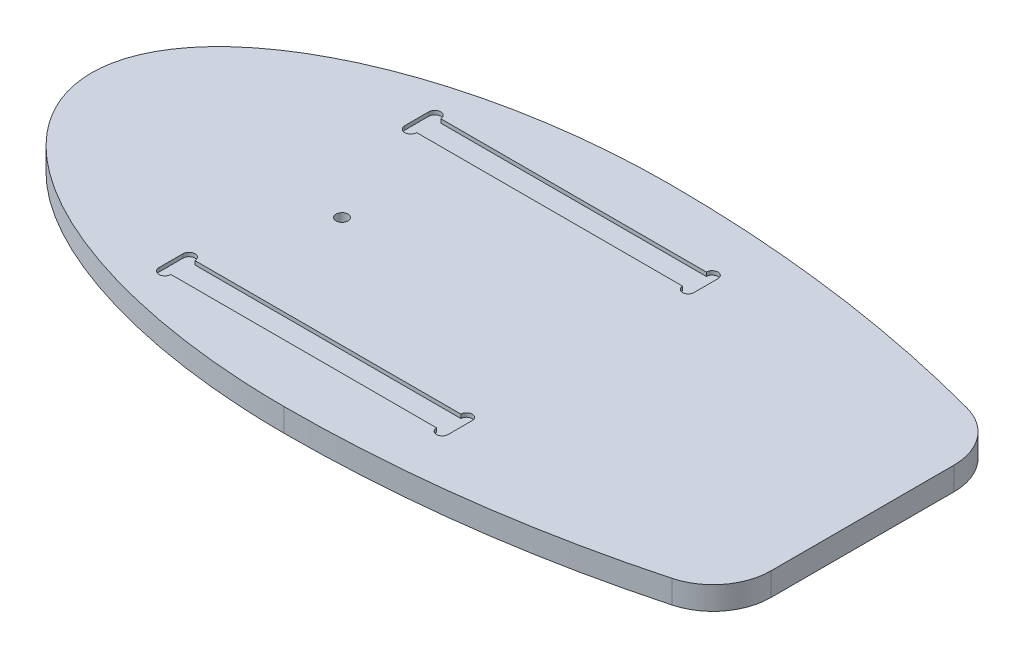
ISO-10303-21;
HEADER;
FILE_DESCRIPTION(('STEP AP214'),'2;1');
FILE_NAME('part.step','',(''),(''),'','','');
FILE_SCHEMA(('AUTOMOTIVE_DESIGN { 1 0 10303 214 1 1 1 1 }'));
ENDSEC;
DATA;
#1=APPLICATION_CONTEXT('core data for automotive mechanical design processes');
#2=APPLICATION_PROTOCOL_DEFINITION('international standard','automotive_design',2000,#1);
#3=PRODUCT_CONTEXT('',#1,'mechanical');
#4=PRODUCT('Part','Part','',(#3));
#5=PRODUCT_RELATED_PRODUCT_CATEGORY('part','',(#4));
#6=PRODUCT_DEFINITION_FORMATION('','',#4);
#7=PRODUCT_DEFINITION_CONTEXT('part definition',#1,'design');
#8=PRODUCT_DEFINITION('design','',#6,#7);
#9=PRODUCT_DEFINITION_SHAPE('','',#8);
#10=(LENGTH_UNIT() NAMED_UNIT(*) SI_UNIT(.MILLI.,.METRE.));
#11=(NAMED_UNIT(*) PLANE_ANGLE_UNIT() SI_UNIT($,.RADIAN.));
#12=(NAMED_UNIT(*) SI_UNIT($,.STERADIAN.) SOLID_ANGLE_UNIT());
#13=UNCERTAINTY_MEASURE_WITH_UNIT(LENGTH_MEASURE(1.E-05),#10,'distance_accuracy_value','');
#14=(GEOMETRIC_REPRESENTATION_CONTEXT(3) GLOBAL_UNCERTAINTY_ASSIGNED_CONTEXT((#13)) GLOBAL_UNIT_ASSIGNED_CONTEXT((#10,
#11,#12)) REPRESENTATION_CONTEXT('',''));
#15=CARTESIAN_POINT('',(0.,0.,0.));
#16=DIRECTION('',(0.,0.,1.));
#17=DIRECTION('',(1.,0.,0.));
#18=AXIS2_PLACEMENT_3D('',#15,#16,#17);
#19=CARTESIAN_POINT('',(0.,0.,0.));
#20=DIRECTION('',(0.,1.,0.));
#21=DIRECTION('',(0.,0.,1.));
#22=AXIS2_PLACEMENT_3D('',#19,#20,#21);
#23=PLANE('',#22);
#24=CARTESIAN_POINT('',(-70.,0.,0.));
#25=DIRECTION('',(0.,1.,0.));
#26=DIRECTION('',(0.,0.,1.));
#27=AXIS2_PLACEMENT_3D('',#24,#25,#26);
#28=CIRCLE('',#27,3.1);
#29=CARTESIAN_POINT('',(-70.,0.,3.1));
#30=VERTEX_POINT('',#29);
#31=EDGE_CURVE('E445',#30,#30,#28,.T.);
#32=ORIENTED_EDGE('',*,*,#31,.F.);
#33=EDGE_LOOP('',(#32));
#34=FACE_BOUND('',#33,.T.);
#35=CARTESIAN_POINT('',(-91.8999999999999,0.,-57.5));
#36=DIRECTION('',(0.,1.,0.));
#37=DIRECTION('',(0.,0.,1.));
#38=AXIS2_PLACEMENT_3D('',#35,#36,#37);
#39=CIRCLE('',#38,3.10000000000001);
#40=CARTESIAN_POINT('',(-94.9999999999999,0.,-57.5));
#41=VERTEX_POINT('',#40);
#42=CARTESIAN_POINT('',(-88.7999999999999,0.,-57.5));
#43=VERTEX_POINT('',#42);
#44=EDGE_CURVE('E187',#41,#43,#39,.T.);
#45=ORIENTED_EDGE('',*,*,#44,.F.);
#46=DIRECTION('',(0.,0.,1.));
#47=VECTOR('',#46,1.);
#48=CARTESIAN_POINT('',(-95.,0.,-70.));
#49=LINE('',#48,#47);
#50=CARTESIAN_POINT('',(-95.,0.,-70.));
#51=VERTEX_POINT('',#50);
#52=EDGE_CURVE('E198',#51,#41,#49,.T.);
#53=ORIENTED_EDGE('',*,*,#52,.F.);
#54=CARTESIAN_POINT('',(-91.9,0.,-70.));
#55=DIRECTION('',(0.,1.,0.));
#56=DIRECTION('',(0.,0.,1.));
#57=AXIS2_PLACEMENT_3D('',#54,#55,#56);
#58=CIRCLE('',#57,3.10000000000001);
#59=CARTESIAN_POINT('',(-88.8,0.,-70.));
#60=VERTEX_POINT('',#59);
#61=EDGE_CURVE('E203',#60,#51,#58,.T.);
#62=ORIENTED_EDGE('',*,*,#61,.F.);
#63=DIRECTION('',(1.,0.,0.));
#64=VECTOR('',#63,1.);
#65=CARTESIAN_POINT('',(-88.8,0.,-70.));
#66=LINE('',#65,#64);
#67=CARTESIAN_POINT('',(49.,0.,-70.));
#68=VERTEX_POINT('',#67);
#69=EDGE_CURVE('E463',#60,#68,#66,.T.);
#70=ORIENTED_EDGE('',*,*,#69,.T.);
#71=CARTESIAN_POINT('',(52.,0.,-70.));
#72=DIRECTION('',(0.,1.,0.));
#73=DIRECTION('',(0.,0.,1.));
#74=AXIS2_PLACEMENT_3D('',#71,#72,#73);
#75=CIRCLE('',#74,3.);
#76=CARTESIAN_POINT('',(55.,0.,-70.));
#77=VERTEX_POINT('',#76);
#78=EDGE_CURVE('E466',#77,#68,#75,.T.);
#79=ORIENTED_EDGE('',*,*,#78,.F.);
#80=DIRECTION('',(0.,0.,1.));
#81=VECTOR('',#80,1.);
#82=CARTESIAN_POINT('',(55.,0.,-70.));
#83=LINE('',#82,#81);
#84=CARTESIAN_POINT('',(55.,0.,-57.5));
#85=VERTEX_POINT('',#84);
#86=EDGE_CURVE('E469',#77,#85,#83,.T.);
#87=ORIENTED_EDGE('',*,*,#86,.T.);
#88=CARTESIAN_POINT('',(52.0884145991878,0.,-57.5));
#89=DIRECTION('',(0.,1.,0.));
#90=DIRECTION('',(0.,0.,1.));
#91=AXIS2_PLACEMENT_3D('',#88,#89,#90);
#92=CIRCLE('',#91,2.91158540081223);
#93=CARTESIAN_POINT('',(49.1768291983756,0.,-57.5));
#94=VERTEX_POINT('',#93);
#95=EDGE_CURVE('E215',#94,#85,#92,.T.);
#96=ORIENTED_EDGE('',*,*,#95,.F.);
#97=DIRECTION('',(1.,0.,0.));
#98=VECTOR('',#97,1.);
#99=CARTESIAN_POINT('',(-88.7999999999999,0.,-57.5));
#100=LINE('',#99,#98);
#101=EDGE_CURVE('E209',#43,#94,#100,.T.);
#102=ORIENTED_EDGE('',*,*,#101,.F.);
#103=EDGE_LOOP('',(#45,#53,#62,#70,#79,#87,#96,#102));
#104=FACE_BOUND('',#103,.T.);
#105=CARTESIAN_POINT('',(-1.43868235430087E-13,0.,-584.654570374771));
#106=DIRECTION('',(0.,1.,0.));
#107=DIRECTION('',(0.,0.,1.));
#108=AXIS2_PLACEMENT_3D('',#105,#106,#107);
#109=CIRCLE('',#108,684.654570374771);
#110=CARTESIAN_POINT('',(0.,0.,100.));
#111=VERTEX_POINT('',#110);
#112=CARTESIAN_POINT('',(177.790367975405,0.,76.5129316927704));
#113=VERTEX_POINT('',#112);
#114=EDGE_CURVE('E347',#111,#113,#109,.T.);
#115=ORIENTED_EDGE('',*,*,#114,.T.);
#116=CARTESIAN_POINT('',(170.,0.,47.5420813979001));
#117=DIRECTION('',(0.,1.,0.));
#118=DIRECTION('',(0.,0.,1.));
#119=AXIS2_PLACEMENT_3D('',#116,#117,#118);
#120=CIRCLE('',#119,30.);
#121=CARTESIAN_POINT('',(200.,0.,47.5420813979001));
#122=VERTEX_POINT('',#121);
#123=EDGE_CURVE('E350',#113,#122,#120,.T.);
#124=ORIENTED_EDGE('',*,*,#123,.T.);
#125=DIRECTION('',(0.,0.,1.));
#126=VECTOR('',#125,1.);
#127=CARTESIAN_POINT('',(200.,0.,-70.136908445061));
#128=LINE('',#127,#126);
#129=CARTESIAN_POINT('',(200.,0.,-47.5420813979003));
#130=VERTEX_POINT('',#129);
#131=EDGE_CURVE('E344',#130,#122,#128,.T.);
#132=ORIENTED_EDGE('',*,*,#131,.F.);
#133=CARTESIAN_POINT('',(170.,0.,-47.5420813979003));
#134=DIRECTION('',(0.,1.,0.));
#135=DIRECTION('',(0.,0.,1.));
#136=AXIS2_PLACEMENT_3D('',#133,#134,#135);
#137=CIRCLE('',#136,30.);
#138=CARTESIAN_POINT('',(177.790367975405,0.,-76.5129316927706));
#139=VERTEX_POINT('',#138);
#140=EDGE_CURVE('E366',#130,#139,#137,.T.);
#141=ORIENTED_EDGE('',*,*,#140,.T.);
#142=CARTESIAN_POINT('',(0.,0.,584.654570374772));
#143=DIRECTION('',(0.,-1.,0.));
#144=DIRECTION('',(0.,0.,-1.));
#145=AXIS2_PLACEMENT_3D('',#142,#143,#144);
#146=CIRCLE('',#145,684.654570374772);
#147=CARTESIAN_POINT('',(0.,0.,-100.));
#148=VERTEX_POINT('',#147);
#149=EDGE_CURVE('E302',#148,#139,#146,.T.);
#150=ORIENTED_EDGE('',*,*,#149,.F.);
#151=CARTESIAN_POINT('',(0.,0.,0.));
#152=DIRECTION('',(0.,1.,0.));
#153=DIRECTION('',(-1.,0.,0.));
#154=AXIS2_PLACEMENT_3D('',#151,#152,#153);
#155=ELLIPSE('',#154,200.,100.);
#156=EDGE_CURVE('E296',#148,#111,#155,.T.);
#157=ORIENTED_EDGE('',*,*,#156,.T.);
#158=EDGE_LOOP('',(#115,#124,#132,#141,#150,#157));
#159=FACE_BOUND('',#158,.T.);
#160=DIRECTION('',(0.,0.,-1.));
#161=VECTOR('',#160,1.);
#162=CARTESIAN_POINT('',(-95.,0.,70.));
#163=LINE('',#162,#161);
#164=CARTESIAN_POINT('',(-95.,0.,70.));
#165=VERTEX_POINT('',#164);
#166=CARTESIAN_POINT('',(-94.9999999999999,0.,57.5));
#167=VERTEX_POINT('',#166);
#168=EDGE_CURVE('E243',#165,#167,#163,.T.);
#169=ORIENTED_EDGE('',*,*,#168,.T.);
#170=CARTESIAN_POINT('',(-91.8999999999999,0.,57.5));
#171=DIRECTION('',(0.,-1.,0.));
#172=DIRECTION('',(0.,0.,-1.));
#173=AXIS2_PLACEMENT_3D('',#170,#171,#172);
#174=CIRCLE('',#173,3.10000000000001);
#175=CARTESIAN_POINT('',(-88.7999999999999,0.,57.5));
#176=VERTEX_POINT('',#175);
#177=EDGE_CURVE('E210',#167,#176,#174,.T.);
#178=ORIENTED_EDGE('',*,*,#177,.T.);
#179=DIRECTION('',(1.,0.,0.));
#180=VECTOR('',#179,1.);
#181=CARTESIAN_POINT('',(-88.7999999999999,0.,57.5));
#182=LINE('',#181,#180);
#183=CARTESIAN_POINT('',(49.1768291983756,0.,57.4999999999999));
#184=VERTEX_POINT('',#183);
#185=EDGE_CURVE('E213',#176,#184,#182,.T.);
#186=ORIENTED_EDGE('',*,*,#185,.T.);
#187=CARTESIAN_POINT('',(52.0884145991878,0.,57.4999999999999));
#188=DIRECTION('',(0.,-1.,0.));
#189=DIRECTION('',(0.,0.,-1.));
#190=AXIS2_PLACEMENT_3D('',#187,#188,#189);
#191=CIRCLE('',#190,2.91158540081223);
#192=CARTESIAN_POINT('',(55.0000000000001,0.,57.4999999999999));
#193=VERTEX_POINT('',#192);
#194=EDGE_CURVE('E262',#184,#193,#191,.T.);
#195=ORIENTED_EDGE('',*,*,#194,.T.);
#196=DIRECTION('',(0.,0.,-1.));
#197=VECTOR('',#196,1.);
#198=CARTESIAN_POINT('',(55.0000000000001,0.,69.9999999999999));
#199=LINE('',#198,#197);
#200=CARTESIAN_POINT('',(55.0000000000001,0.,69.9999999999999));
#201=VERTEX_POINT('',#200);
#202=EDGE_CURVE('E265',#201,#193,#199,.T.);
#203=ORIENTED_EDGE('',*,*,#202,.F.);
#204=CARTESIAN_POINT('',(52.0000000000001,0.,69.9999999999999));
#205=DIRECTION('',(0.,-1.,0.));
#206=DIRECTION('',(0.,0.,-1.));
#207=AXIS2_PLACEMENT_3D('',#204,#205,#206);
#208=CIRCLE('',#207,3.);
#209=CARTESIAN_POINT('',(49.0000000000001,0.,69.9999999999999));
#210=VERTEX_POINT('',#209);
#211=EDGE_CURVE('E268',#201,#210,#208,.T.);
#212=ORIENTED_EDGE('',*,*,#211,.T.);
#213=DIRECTION('',(1.,0.,0.));
#214=VECTOR('',#213,1.);
#215=CARTESIAN_POINT('',(-88.8,0.,70.));
#216=LINE('',#215,#214);
#217=CARTESIAN_POINT('',(-88.8,0.,70.));
#218=VERTEX_POINT('',#217);
#219=EDGE_CURVE('E271',#218,#210,#216,.T.);
#220=ORIENTED_EDGE('',*,*,#219,.F.);
#221=CARTESIAN_POINT('',(-91.8999999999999,0.,70.));
#222=DIRECTION('',(0.,-1.,0.));
#223=DIRECTION('',(0.,0.,-1.));
#224=AXIS2_PLACEMENT_3D('',#221,#222,#223);
#225=CIRCLE('',#224,3.10000000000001);
#226=EDGE_CURVE('E274',#218,#165,#225,.T.);
#227=ORIENTED_EDGE('',*,*,#226,.T.);
#228=EDGE_LOOP('',(#169,#178,#186,#195,#203,#212,#220,#227));
#229=FACE_BOUND('',#228,.T.);
#230=ADVANCED_FACE('F33',(#34,#104,#159,#229),#23,.T.);
#231=CARTESIAN_POINT('',(0.,-12.,0.));
#232=DIRECTION('',(0.,1.,0.));
#233=DIRECTION('',(-1.,0.,0.));
#234=AXIS2_PLACEMENT_3D('',#231,#232,#233);
#235=ELLIPSE('',#234,200.,100.);
#236=DIRECTION('',(0.,1.,0.));
#237=VECTOR('',#236,1.);
#238=SURFACE_OF_LINEAR_EXTRUSION('',#235,#237);
#239=ORIENTED_EDGE('',*,*,#156,.F.);
#240=DIRECTION('',(0.,1.,0.));
#241=VECTOR('',#240,1.);
#242=CARTESIAN_POINT('',(0.,-12.,-100.));
#243=LINE('',#242,#241);
#244=CARTESIAN_POINT('',(0.,-12.,-100.));
#245=VERTEX_POINT('',#244);
#246=EDGE_CURVE('E367',#245,#148,#243,.T.);
#247=ORIENTED_EDGE('',*,*,#246,.F.);
#248=CARTESIAN_POINT('',(0.,-12.,100.));
#249=VERTEX_POINT('',#248);
#250=EDGE_CURVE('E297',#245,#249,#235,.T.);
#251=ORIENTED_EDGE('',*,*,#250,.T.);
#252=DIRECTION('',(0.,1.,0.));
#253=VECTOR('',#252,1.);
#254=CARTESIAN_POINT('',(0.,-12.,100.));
#255=LINE('',#254,#253);
#256=EDGE_CURVE('E365',#249,#111,#255,.T.);
#257=ORIENTED_EDGE('',*,*,#256,.T.);
#258=EDGE_LOOP('',(#239,#247,#251,#257));
#259=FACE_BOUND('',#258,.T.);
#260=ADVANCED_FACE('F305',(#259),#238,.T.);
#261=CARTESIAN_POINT('',(0.,-12.,584.654570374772));
#262=DIRECTION('',(0.,1.,0.));
#263=DIRECTION('',(0.,0.,1.));
#264=AXIS2_PLACEMENT_3D('',#261,#262,#263);
#265=CYLINDRICAL_SURFACE('',#264,684.654570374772);
#266=ORIENTED_EDGE('',*,*,#149,.T.);
#267=DIRECTION('',(0.,1.,0.));
#268=VECTOR('',#267,1.);
#269=CARTESIAN_POINT('',(177.790367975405,-12.,-76.5129316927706));
#270=LINE('',#269,#268);
#271=CARTESIAN_POINT('',(177.790367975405,-12.,-76.5129316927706));
#272=VERTEX_POINT('',#271);
#273=EDGE_CURVE('E11',#139,#272,#270,.F.);
#274=ORIENTED_EDGE('',*,*,#273,.T.);
#275=CARTESIAN_POINT('',(0.,-12.,584.654570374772));
#276=DIRECTION('',(0.,-1.,0.));
#277=DIRECTION('',(0.,0.,-1.));
#278=AXIS2_PLACEMENT_3D('',#275,#276,#277);
#279=CIRCLE('',#278,684.654570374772);
#280=EDGE_CURVE('E381',#245,#272,#279,.T.);
#281=ORIENTED_EDGE('',*,*,#280,.F.);
#282=ORIENTED_EDGE('',*,*,#246,.T.);
#283=EDGE_LOOP('',(#266,#274,#281,#282));
#284=FACE_BOUND('',#283,.T.);
#285=ADVANCED_FACE('F308',(#284),#265,.T.);
#286=CARTESIAN_POINT('',(200.,-12.,-70.136908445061));
#287=DIRECTION('',(-1.,0.,0.));
#288=DIRECTION('',(0.,0.,1.));
#289=AXIS2_PLACEMENT_3D('',#286,#287,#288);
#290=PLANE('',#289);
#291=ORIENTED_EDGE('',*,*,#131,.T.);
#292=DIRECTION('',(0.,-1.,0.));
#293=VECTOR('',#292,1.);
#294=CARTESIAN_POINT('',(200.,-12.,47.5420813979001));
#295=LINE('',#294,#293);
#296=CARTESIAN_POINT('',(200.,-12.,47.5420813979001));
#297=VERTEX_POINT('',#296);
#298=EDGE_CURVE('E54',#122,#297,#295,.T.);
#299=ORIENTED_EDGE('',*,*,#298,.T.);
#300=DIRECTION('',(0.,0.,1.));
#301=VECTOR('',#300,1.);
#302=CARTESIAN_POINT('',(200.,-12.,-70.136908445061));
#303=LINE('',#302,#301);
#304=CARTESIAN_POINT('',(200.,-12.,-47.5420813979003));
#305=VERTEX_POINT('',#304);
#306=EDGE_CURVE('E361',#305,#297,#303,.T.);
#307=ORIENTED_EDGE('',*,*,#306,.F.);
#308=DIRECTION('',(0.,1.,0.));
#309=VECTOR('',#308,1.);
#310=CARTESIAN_POINT('',(200.,-12.,-47.5420813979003));
#311=LINE('',#310,#309);
#312=EDGE_CURVE('E346',#305,#130,#311,.T.);
#313=ORIENTED_EDGE('',*,*,#312,.T.);
#314=EDGE_LOOP('',(#291,#299,#307,#313));
#315=FACE_BOUND('',#314,.T.);
#316=ADVANCED_FACE('F336',(#315),#290,.F.);
#317=CARTESIAN_POINT('',(-1.43868235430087E-13,-12.,-584.654570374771));
#318=DIRECTION('',(0.,1.,0.));
#319=DIRECTION('',(0.,0.,1.));
#320=AXIS2_PLACEMENT_3D('',#317,#318,#319);
#321=CYLINDRICAL_SURFACE('',#320,684.654570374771);
#322=CARTESIAN_POINT('',(-1.43868235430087E-13,-12.,-584.654570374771));
#323=DIRECTION('',(0.,1.,0.));
#324=DIRECTION('',(0.,0.,1.));
#325=AXIS2_PLACEMENT_3D('',#322,#323,#324);
#326=CIRCLE('',#325,684.654570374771);
#327=CARTESIAN_POINT('',(177.790367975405,-12.,76.5129316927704));
#328=VERTEX_POINT('',#327);
#329=EDGE_CURVE('E301',#249,#328,#326,.T.);
#330=ORIENTED_EDGE('',*,*,#329,.T.);
#331=DIRECTION('',(0.,1.,0.));
#332=VECTOR('',#331,1.);
#333=CARTESIAN_POINT('',(177.790367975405,-12.,76.5129316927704));
#334=LINE('',#333,#332);
#335=EDGE_CURVE('E363',#328,#113,#334,.T.);
#336=ORIENTED_EDGE('',*,*,#335,.T.);
#337=ORIENTED_EDGE('',*,*,#114,.F.);
#338=ORIENTED_EDGE('',*,*,#256,.F.);
#339=EDGE_LOOP('',(#330,#336,#337,#338));
#340=FACE_BOUND('',#339,.T.);
#341=ADVANCED_FACE('F310',(#340),#321,.T.);
#342=CARTESIAN_POINT('',(0.,-12.,0.));
#343=DIRECTION('',(0.,1.,0.));
#344=DIRECTION('',(0.,0.,1.));
#345=AXIS2_PLACEMENT_3D('',#342,#343,#344);
#346=PLANE('',#345);
#347=CARTESIAN_POINT('',(-70.,-12.,0.));
#348=DIRECTION('',(0.,1.,0.));
#349=DIRECTION('',(0.,0.,1.));
#350=AXIS2_PLACEMENT_3D('',#347,#348,#349);
#351=CIRCLE('',#350,3.1);
#352=CARTESIAN_POINT('',(-70.,-12.,3.1));
#353=VERTEX_POINT('',#352);
#354=EDGE_CURVE('E195',#353,#353,#351,.T.);
#355=ORIENTED_EDGE('',*,*,#354,.T.);
#356=EDGE_LOOP('',(#355));
#357=FACE_BOUND('',#356,.T.);
#358=ORIENTED_EDGE('',*,*,#306,.T.);
#359=CARTESIAN_POINT('',(170.,-12.,47.5420813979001));
#360=DIRECTION('',(0.,1.,0.));
#361=DIRECTION('',(0.,0.,1.));
#362=AXIS2_PLACEMENT_3D('',#359,#360,#361);
#363=CIRCLE('',#362,30.);
#364=EDGE_CURVE('E41',#297,#328,#363,.F.);
#365=ORIENTED_EDGE('',*,*,#364,.T.);
#366=ORIENTED_EDGE('',*,*,#329,.F.);
#367=ORIENTED_EDGE('',*,*,#250,.F.);
#368=ORIENTED_EDGE('',*,*,#280,.T.);
#369=CARTESIAN_POINT('',(170.,-12.,-47.5420813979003));
#370=DIRECTION('',(0.,1.,0.));
#371=DIRECTION('',(0.,0.,1.));
#372=AXIS2_PLACEMENT_3D('',#369,#370,#371);
#373=CIRCLE('',#372,30.);
#374=EDGE_CURVE('E352',#272,#305,#373,.F.);
#375=ORIENTED_EDGE('',*,*,#374,.T.);
#376=EDGE_LOOP('',(#358,#365,#366,#367,#368,#375));
#377=FACE_BOUND('',#376,.T.);
#378=ADVANCED_FACE('F333',(#357,#377),#346,.F.);
#379=CARTESIAN_POINT('',(-91.8999999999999,-2.,57.5));
#380=DIRECTION('',(0.,1.,0.));
#381=DIRECTION('',(0.,0.,1.));
#382=AXIS2_PLACEMENT_3D('',#379,#380,#381);
#383=CYLINDRICAL_SURFACE('',#382,3.10000000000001);
#384=ORIENTED_EDGE('',*,*,#177,.F.);
#385=DIRECTION('',(0.,1.,0.));
#386=VECTOR('',#385,1.);
#387=CARTESIAN_POINT('',(-94.9999999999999,-2.,57.5));
#388=LINE('',#387,#386);
#389=CARTESIAN_POINT('',(-94.9999999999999,-2.,57.5));
#390=VERTEX_POINT('',#389);
#391=EDGE_CURVE('E258',#390,#167,#388,.T.);
#392=ORIENTED_EDGE('',*,*,#391,.F.);
#393=CARTESIAN_POINT('',(-91.8999999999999,-2.,57.5));
#394=DIRECTION('',(0.,-1.,0.));
#395=DIRECTION('',(0.,0.,-1.));
#396=AXIS2_PLACEMENT_3D('',#393,#394,#395);
#397=CIRCLE('',#396,3.10000000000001);
#398=CARTESIAN_POINT('',(-88.7999999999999,-2.,57.5));
#399=VERTEX_POINT('',#398);
#400=EDGE_CURVE('E239',#390,#399,#397,.T.);
#401=ORIENTED_EDGE('',*,*,#400,.T.);
#402=DIRECTION('',(0.,1.,0.));
#403=VECTOR('',#402,1.);
#404=CARTESIAN_POINT('',(-88.7999999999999,-2.,57.5));
#405=LINE('',#404,#403);
#406=EDGE_CURVE('E293',#399,#176,#405,.T.);
#407=ORIENTED_EDGE('',*,*,#406,.T.);
#408=EDGE_LOOP('',(#384,#392,#401,#407));
#409=FACE_BOUND('',#408,.T.);
#410=ADVANCED_FACE('F392',(#409),#383,.F.);
#411=CARTESIAN_POINT('',(-88.7999999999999,-2.,57.5));
#412=DIRECTION('',(0.,0.,1.));
#413=DIRECTION('',(1.,0.,0.));
#414=AXIS2_PLACEMENT_3D('',#411,#412,#413);
#415=PLANE('',#414);
#416=ORIENTED_EDGE('',*,*,#185,.F.);
#417=ORIENTED_EDGE('',*,*,#406,.F.);
#418=DIRECTION('',(1.,0.,0.));
#419=VECTOR('',#418,1.);
#420=CARTESIAN_POINT('',(-88.7999999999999,-2.,57.5));
#421=LINE('',#420,#419);
#422=CARTESIAN_POINT('',(49.1768291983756,-2.,57.4999999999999));
#423=VERTEX_POINT('',#422);
#424=EDGE_CURVE('E242',#399,#423,#421,.T.);
#425=ORIENTED_EDGE('',*,*,#424,.T.);
#426=DIRECTION('',(0.,1.,0.));
#427=VECTOR('',#426,1.);
#428=CARTESIAN_POINT('',(49.1768291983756,-2.,57.4999999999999));
#429=LINE('',#428,#427);
#430=EDGE_CURVE('E291',#423,#184,#429,.T.);
#431=ORIENTED_EDGE('',*,*,#430,.T.);
#432=EDGE_LOOP('',(#416,#417,#425,#431));
#433=FACE_BOUND('',#432,.T.);
#434=ADVANCED_FACE('F400',(#433),#415,.T.);
#435=CARTESIAN_POINT('',(52.0884145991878,-2.,57.4999999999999));
#436=DIRECTION('',(0.,1.,0.));
#437=DIRECTION('',(0.,0.,1.));
#438=AXIS2_PLACEMENT_3D('',#435,#436,#437);
#439=CYLINDRICAL_SURFACE('',#438,2.91158540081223);
#440=ORIENTED_EDGE('',*,*,#194,.F.);
#441=ORIENTED_EDGE('',*,*,#430,.F.);
#442=CARTESIAN_POINT('',(52.0884145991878,-2.,57.4999999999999));
#443=DIRECTION('',(0.,-1.,0.));
#444=DIRECTION('',(0.,0.,-1.));
#445=AXIS2_PLACEMENT_3D('',#442,#443,#444);
#446=CIRCLE('',#445,2.91158540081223);
#447=CARTESIAN_POINT('',(55.0000000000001,-2.,57.4999999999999));
#448=VERTEX_POINT('',#447);
#449=EDGE_CURVE('E245',#423,#448,#446,.T.);
#450=ORIENTED_EDGE('',*,*,#449,.T.);
#451=DIRECTION('',(0.,1.,0.));
#452=VECTOR('',#451,1.);
#453=CARTESIAN_POINT('',(55.0000000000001,-2.,57.4999999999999));
#454=LINE('',#453,#452);
#455=EDGE_CURVE('E289',#448,#193,#454,.T.);
#456=ORIENTED_EDGE('',*,*,#455,.T.);
#457=EDGE_LOOP('',(#440,#441,#450,#456));
#458=FACE_BOUND('',#457,.T.);
#459=ADVANCED_FACE('F403',(#458),#439,.F.);
#460=CARTESIAN_POINT('',(55.0000000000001,-2.,69.9999999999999));
#461=DIRECTION('',(1.,0.,0.));
#462=DIRECTION('',(0.,0.,-1.));
#463=AXIS2_PLACEMENT_3D('',#460,#461,#462);
#464=PLANE('',#463);
#465=ORIENTED_EDGE('',*,*,#202,.T.);
#466=ORIENTED_EDGE('',*,*,#455,.F.);
#467=DIRECTION('',(0.,0.,-1.));
#468=VECTOR('',#467,1.);
#469=CARTESIAN_POINT('',(55.0000000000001,-2.,69.9999999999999));
#470=LINE('',#469,#468);
#471=CARTESIAN_POINT('',(55.0000000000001,-2.,69.9999999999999));
#472=VERTEX_POINT('',#471);
#473=EDGE_CURVE('E247',#472,#448,#470,.T.);
#474=ORIENTED_EDGE('',*,*,#473,.F.);
#475=DIRECTION('',(0.,1.,0.));
#476=VECTOR('',#475,1.);
#477=CARTESIAN_POINT('',(55.0000000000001,-2.,69.9999999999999));
#478=LINE('',#477,#476);
#479=EDGE_CURVE('E287',#472,#201,#478,.T.);
#480=ORIENTED_EDGE('',*,*,#479,.T.);
#481=EDGE_LOOP('',(#465,#466,#474,#480));
#482=FACE_BOUND('',#481,.T.);
#483=ADVANCED_FACE('F408',(#482),#464,.F.);
#484=CARTESIAN_POINT('',(52.0000000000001,-2.,69.9999999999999));
#485=DIRECTION('',(0.,1.,0.));
#486=DIRECTION('',(0.,0.,1.));
#487=AXIS2_PLACEMENT_3D('',#484,#485,#486);
#488=CYLINDRICAL_SURFACE('',#487,3.);
#489=ORIENTED_EDGE('',*,*,#211,.F.);
#490=ORIENTED_EDGE('',*,*,#479,.F.);
#491=CARTESIAN_POINT('',(52.0000000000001,-2.,69.9999999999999));
#492=DIRECTION('',(0.,-1.,0.));
#493=DIRECTION('',(0.,0.,-1.));
#494=AXIS2_PLACEMENT_3D('',#491,#492,#493);
#495=CIRCLE('',#494,3.);
#496=CARTESIAN_POINT('',(49.0000000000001,-2.,69.9999999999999));
#497=VERTEX_POINT('',#496);
#498=EDGE_CURVE('E250',#472,#497,#495,.T.);
#499=ORIENTED_EDGE('',*,*,#498,.T.);
#500=DIRECTION('',(0.,1.,0.));
#501=VECTOR('',#500,1.);
#502=CARTESIAN_POINT('',(49.0000000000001,-2.,69.9999999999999));
#503=LINE('',#502,#501);
#504=EDGE_CURVE('E285',#497,#210,#503,.T.);
#505=ORIENTED_EDGE('',*,*,#504,.T.);
#506=EDGE_LOOP('',(#489,#490,#499,#505));
#507=FACE_BOUND('',#506,.T.);
#508=ADVANCED_FACE('F412',(#507),#488,.F.);
#509=CARTESIAN_POINT('',(-88.8,-2.,70.));
#510=DIRECTION('',(0.,0.,1.));
#511=DIRECTION('',(1.,0.,0.));
#512=AXIS2_PLACEMENT_3D('',#509,#510,#511);
#513=PLANE('',#512);
#514=ORIENTED_EDGE('',*,*,#219,.T.);
#515=ORIENTED_EDGE('',*,*,#504,.F.);
#516=DIRECTION('',(1.,0.,0.));
#517=VECTOR('',#516,1.);
#518=CARTESIAN_POINT('',(-88.8,-2.,70.));
#519=LINE('',#518,#517);
#520=CARTESIAN_POINT('',(-88.8,-2.,70.));
#521=VERTEX_POINT('',#520);
#522=EDGE_CURVE('E252',#521,#497,#519,.T.);
#523=ORIENTED_EDGE('',*,*,#522,.F.);
#524=DIRECTION('',(0.,1.,0.));
#525=VECTOR('',#524,1.);
#526=CARTESIAN_POINT('',(-88.8,-2.,70.));
#527=LINE('',#526,#525);
#528=EDGE_CURVE('E283',#521,#218,#527,.T.);
#529=ORIENTED_EDGE('',*,*,#528,.T.);
#530=EDGE_LOOP('',(#514,#515,#523,#529));
#531=FACE_BOUND('',#530,.T.);
#532=ADVANCED_FACE('F416',(#531),#513,.F.);
#533=CARTESIAN_POINT('',(-91.8999999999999,-2.,70.));
#534=DIRECTION('',(0.,1.,0.));
#535=DIRECTION('',(0.,0.,1.));
#536=AXIS2_PLACEMENT_3D('',#533,#534,#535);
#537=CYLINDRICAL_SURFACE('',#536,3.10000000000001);
#538=ORIENTED_EDGE('',*,*,#226,.F.);
#539=ORIENTED_EDGE('',*,*,#528,.F.);
#540=CARTESIAN_POINT('',(-91.8999999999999,-2.,70.));
#541=DIRECTION('',(0.,-1.,0.));
#542=DIRECTION('',(0.,0.,-1.));
#543=AXIS2_PLACEMENT_3D('',#540,#541,#542);
#544=CIRCLE('',#543,3.10000000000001);
#545=CARTESIAN_POINT('',(-95.,-2.,70.));
#546=VERTEX_POINT('',#545);
#547=EDGE_CURVE('E255',#521,#546,#544,.T.);
#548=ORIENTED_EDGE('',*,*,#547,.T.);
#549=DIRECTION('',(0.,1.,0.));
#550=VECTOR('',#549,1.);
#551=CARTESIAN_POINT('',(-95.,-2.,70.));
#552=LINE('',#551,#550);
#553=EDGE_CURVE('E281',#546,#165,#552,.T.);
#554=ORIENTED_EDGE('',*,*,#553,.T.);
#555=EDGE_LOOP('',(#538,#539,#548,#554));
#556=FACE_BOUND('',#555,.T.);
#557=ADVANCED_FACE('F418',(#556),#537,.F.);
#558=CARTESIAN_POINT('',(-95.,-2.,70.));
#559=DIRECTION('',(1.,0.,0.));
#560=DIRECTION('',(0.,0.,-1.));
#561=AXIS2_PLACEMENT_3D('',#558,#559,#560);
#562=PLANE('',#561);
#563=ORIENTED_EDGE('',*,*,#168,.F.);
#564=ORIENTED_EDGE('',*,*,#553,.F.);
#565=DIRECTION('',(0.,0.,-1.));
#566=VECTOR('',#565,1.);
#567=CARTESIAN_POINT('',(-95.,-2.,70.));
#568=LINE('',#567,#566);
#569=EDGE_CURVE('E257',#546,#390,#568,.T.);
#570=ORIENTED_EDGE('',*,*,#569,.T.);
#571=ORIENTED_EDGE('',*,*,#391,.T.);
#572=EDGE_LOOP('',(#563,#564,#570,#571));
#573=FACE_BOUND('',#572,.T.);
#574=ADVANCED_FACE('F387',(#573),#562,.T.);
#575=CARTESIAN_POINT('',(-91.8999999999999,-2.,57.5));
#576=DIRECTION('',(0.,-1.,0.));
#577=DIRECTION('',(0.,0.,-1.));
#578=AXIS2_PLACEMENT_3D('',#575,#576,#577);
#579=PLANE('',#578);
#580=ORIENTED_EDGE('',*,*,#400,.F.);
#581=ORIENTED_EDGE('',*,*,#569,.F.);
#582=ORIENTED_EDGE('',*,*,#547,.F.);
#583=ORIENTED_EDGE('',*,*,#522,.T.);
#584=ORIENTED_EDGE('',*,*,#498,.F.);
#585=ORIENTED_EDGE('',*,*,#473,.T.);
#586=ORIENTED_EDGE('',*,*,#449,.F.);
#587=ORIENTED_EDGE('',*,*,#424,.F.);
#588=EDGE_LOOP('',(#580,#581,#582,#583,#584,#585,#586,#587));
#589=FACE_BOUND('',#588,.T.);
#590=ADVANCED_FACE('F395',(#589),#579,.F.);
#591=CARTESIAN_POINT('',(-91.8999999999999,-2.,-57.5));
#592=DIRECTION('',(0.,1.,0.));
#593=DIRECTION('',(0.,0.,1.));
#594=AXIS2_PLACEMENT_3D('',#591,#592,#593);
#595=CYLINDRICAL_SURFACE('',#594,3.10000000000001);
#596=ORIENTED_EDGE('',*,*,#44,.T.);
#597=DIRECTION('',(0.,1.,0.));
#598=VECTOR('',#597,1.);
#599=CARTESIAN_POINT('',(-88.7999999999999,-2.,-57.5));
#600=LINE('',#599,#598);
#601=CARTESIAN_POINT('',(-88.7999999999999,-2.,-57.5));
#602=VERTEX_POINT('',#601);
#603=EDGE_CURVE('E222',#602,#43,#600,.T.);
#604=ORIENTED_EDGE('',*,*,#603,.F.);
#605=CARTESIAN_POINT('',(-91.8999999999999,-2.,-57.5));
#606=DIRECTION('',(0.,1.,0.));
#607=DIRECTION('',(0.,0.,1.));
#608=AXIS2_PLACEMENT_3D('',#605,#606,#607);
#609=CIRCLE('',#608,3.10000000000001);
#610=CARTESIAN_POINT('',(-94.9999999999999,-2.,-57.5));
#611=VERTEX_POINT('',#610);
#612=EDGE_CURVE('E190',#611,#602,#609,.T.);
#613=ORIENTED_EDGE('',*,*,#612,.F.);
#614=DIRECTION('',(0.,1.,0.));
#615=VECTOR('',#614,1.);
#616=CARTESIAN_POINT('',(-94.9999999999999,-2.,-57.5));
#617=LINE('',#616,#615);
#618=EDGE_CURVE('E183',#611,#41,#617,.T.);
#619=ORIENTED_EDGE('',*,*,#618,.T.);
#620=EDGE_LOOP('',(#596,#604,#613,#619));
#621=FACE_BOUND('',#620,.T.);
#622=ADVANCED_FACE('F185',(#621),#595,.F.);
#623=CARTESIAN_POINT('',(-95.,-2.,-70.));
#624=DIRECTION('',(-1.,0.,0.));
#625=DIRECTION('',(0.,0.,1.));
#626=AXIS2_PLACEMENT_3D('',#623,#624,#625);
#627=PLANE('',#626);
#628=ORIENTED_EDGE('',*,*,#52,.T.);
#629=ORIENTED_EDGE('',*,*,#618,.F.);
#630=DIRECTION('',(0.,0.,1.));
#631=VECTOR('',#630,1.);
#632=CARTESIAN_POINT('',(-95.,-2.,-70.));
#633=LINE('',#632,#631);
#634=CARTESIAN_POINT('',(-95.,-2.,-70.));
#635=VERTEX_POINT('',#634);
#636=EDGE_CURVE('E219',#635,#611,#633,.T.);
#637=ORIENTED_EDGE('',*,*,#636,.F.);
#638=DIRECTION('',(0.,1.,0.));
#639=VECTOR('',#638,1.);
#640=CARTESIAN_POINT('',(-95.,-2.,-70.));
#641=LINE('',#640,#639);
#642=EDGE_CURVE('E194',#635,#51,#641,.T.);
#643=ORIENTED_EDGE('',*,*,#642,.T.);
#644=EDGE_LOOP('',(#628,#629,#637,#643));
#645=FACE_BOUND('',#644,.T.);
#646=ADVANCED_FACE('F199',(#645),#627,.F.);
#647=CARTESIAN_POINT('',(-91.9,-2.,-70.));
#648=DIRECTION('',(0.,1.,0.));
#649=DIRECTION('',(0.,0.,1.));
#650=AXIS2_PLACEMENT_3D('',#647,#648,#649);
#651=CYLINDRICAL_SURFACE('',#650,3.10000000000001);
#652=ORIENTED_EDGE('',*,*,#61,.T.);
#653=ORIENTED_EDGE('',*,*,#642,.F.);
#654=CARTESIAN_POINT('',(-91.9,-2.,-70.));
#655=DIRECTION('',(0.,1.,0.));
#656=DIRECTION('',(0.,0.,1.));
#657=AXIS2_PLACEMENT_3D('',#654,#655,#656);
#658=CIRCLE('',#657,3.10000000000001);
#659=CARTESIAN_POINT('',(-88.8,-2.,-70.));
#660=VERTEX_POINT('',#659);
#661=EDGE_CURVE('E221',#660,#635,#658,.T.);
#662=ORIENTED_EDGE('',*,*,#661,.F.);
#663=DIRECTION('',(0.,1.,0.));
#664=VECTOR('',#663,1.);
#665=CARTESIAN_POINT('',(-88.8,-2.,-70.));
#666=LINE('',#665,#664);
#667=EDGE_CURVE('E459',#660,#60,#666,.T.);
#668=ORIENTED_EDGE('',*,*,#667,.T.);
#669=EDGE_LOOP('',(#652,#653,#662,#668));
#670=FACE_BOUND('',#669,.T.);
#671=ADVANCED_FACE('F492',(#670),#651,.F.);
#672=CARTESIAN_POINT('',(-88.8,-2.,-70.));
#673=DIRECTION('',(0.,0.,1.));
#674=DIRECTION('',(1.,0.,0.));
#675=AXIS2_PLACEMENT_3D('',#672,#673,#674);
#676=PLANE('',#675);
#677=ORIENTED_EDGE('',*,*,#69,.F.);
#678=ORIENTED_EDGE('',*,*,#667,.F.);
#679=DIRECTION('',(1.,0.,0.));
#680=VECTOR('',#679,1.);
#681=CARTESIAN_POINT('',(-88.8,-2.,-70.));
#682=LINE('',#681,#680);
#683=CARTESIAN_POINT('',(49.,-2.,-70.));
#684=VERTEX_POINT('',#683);
#685=EDGE_CURVE('E225',#660,#684,#682,.T.);
#686=ORIENTED_EDGE('',*,*,#685,.T.);
#687=DIRECTION('',(0.,1.,0.));
#688=VECTOR('',#687,1.);
#689=CARTESIAN_POINT('',(49.,-2.,-70.));
#690=LINE('',#689,#688);
#691=EDGE_CURVE('E457',#684,#68,#690,.T.);
#692=ORIENTED_EDGE('',*,*,#691,.T.);
#693=EDGE_LOOP('',(#677,#678,#686,#692));
#694=FACE_BOUND('',#693,.T.);
#695=ADVANCED_FACE('F489',(#694),#676,.T.);
#696=CARTESIAN_POINT('',(52.,-2.,-70.));
#697=DIRECTION('',(0.,1.,0.));
#698=DIRECTION('',(0.,0.,1.));
#699=AXIS2_PLACEMENT_3D('',#696,#697,#698);
#700=CYLINDRICAL_SURFACE('',#699,3.);
#701=ORIENTED_EDGE('',*,*,#78,.T.);
#702=ORIENTED_EDGE('',*,*,#691,.F.);
#703=CARTESIAN_POINT('',(52.,-2.,-70.));
#704=DIRECTION('',(0.,1.,0.));
#705=DIRECTION('',(0.,0.,1.));
#706=AXIS2_PLACEMENT_3D('',#703,#704,#705);
#707=CIRCLE('',#706,3.);
#708=CARTESIAN_POINT('',(55.,-2.,-70.));
#709=VERTEX_POINT('',#708);
#710=EDGE_CURVE('E227',#709,#684,#707,.T.);
#711=ORIENTED_EDGE('',*,*,#710,.F.);
#712=DIRECTION('',(0.,1.,0.));
#713=VECTOR('',#712,1.);
#714=CARTESIAN_POINT('',(55.,-2.,-70.));
#715=LINE('',#714,#713);
#716=EDGE_CURVE('E455',#709,#77,#715,.T.);
#717=ORIENTED_EDGE('',*,*,#716,.T.);
#718=EDGE_LOOP('',(#701,#702,#711,#717));
#719=FACE_BOUND('',#718,.T.);
#720=ADVANCED_FACE('F486',(#719),#700,.F.);
#721=CARTESIAN_POINT('',(55.,-2.,-70.));
#722=DIRECTION('',(-1.,0.,0.));
#723=DIRECTION('',(0.,0.,1.));
#724=AXIS2_PLACEMENT_3D('',#721,#722,#723);
#725=PLANE('',#724);
#726=ORIENTED_EDGE('',*,*,#86,.F.);
#727=ORIENTED_EDGE('',*,*,#716,.F.);
#728=DIRECTION('',(0.,0.,1.));
#729=VECTOR('',#728,1.);
#730=CARTESIAN_POINT('',(55.,-2.,-70.));
#731=LINE('',#730,#729);
#732=CARTESIAN_POINT('',(55.,-2.,-57.5));
#733=VERTEX_POINT('',#732);
#734=EDGE_CURVE('E230',#709,#733,#731,.T.);
#735=ORIENTED_EDGE('',*,*,#734,.T.);
#736=DIRECTION('',(0.,1.,0.));
#737=VECTOR('',#736,1.);
#738=CARTESIAN_POINT('',(55.,-2.,-57.5));
#739=LINE('',#738,#737);
#740=EDGE_CURVE('E453',#733,#85,#739,.T.);
#741=ORIENTED_EDGE('',*,*,#740,.T.);
#742=EDGE_LOOP('',(#726,#727,#735,#741));
#743=FACE_BOUND('',#742,.T.);
#744=ADVANCED_FACE('F479',(#743),#725,.T.);
#745=CARTESIAN_POINT('',(52.0884145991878,-2.,-57.5));
#746=DIRECTION('',(0.,1.,0.));
#747=DIRECTION('',(0.,0.,1.));
#748=AXIS2_PLACEMENT_3D('',#745,#746,#747);
#749=CYLINDRICAL_SURFACE('',#748,2.91158540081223);
#750=ORIENTED_EDGE('',*,*,#95,.T.);
#751=ORIENTED_EDGE('',*,*,#740,.F.);
#752=CARTESIAN_POINT('',(52.0884145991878,-2.,-57.5));
#753=DIRECTION('',(0.,1.,0.));
#754=DIRECTION('',(0.,0.,1.));
#755=AXIS2_PLACEMENT_3D('',#752,#753,#754);
#756=CIRCLE('',#755,2.91158540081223);
#757=CARTESIAN_POINT('',(49.1768291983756,-2.,-57.5));
#758=VERTEX_POINT('',#757);
#759=EDGE_CURVE('E232',#758,#733,#756,.T.);
#760=ORIENTED_EDGE('',*,*,#759,.F.);
#761=DIRECTION('',(0.,1.,0.));
#762=VECTOR('',#761,1.);
#763=CARTESIAN_POINT('',(49.1768291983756,-2.,-57.5));
#764=LINE('',#763,#762);
#765=EDGE_CURVE('E451',#758,#94,#764,.T.);
#766=ORIENTED_EDGE('',*,*,#765,.T.);
#767=EDGE_LOOP('',(#750,#751,#760,#766));
#768=FACE_BOUND('',#767,.T.);
#769=ADVANCED_FACE('F474',(#768),#749,.F.);
#770=CARTESIAN_POINT('',(-88.7999999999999,-2.,-57.5));
#771=DIRECTION('',(0.,0.,1.));
#772=DIRECTION('',(1.,0.,0.));
#773=AXIS2_PLACEMENT_3D('',#770,#771,#772);
#774=PLANE('',#773);
#775=ORIENTED_EDGE('',*,*,#101,.T.);
#776=ORIENTED_EDGE('',*,*,#765,.F.);
#777=DIRECTION('',(1.,0.,0.));
#778=VECTOR('',#777,1.);
#779=CARTESIAN_POINT('',(-88.7999999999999,-2.,-57.5));
#780=LINE('',#779,#778);
#781=EDGE_CURVE('E235',#602,#758,#780,.T.);
#782=ORIENTED_EDGE('',*,*,#781,.F.);
#783=ORIENTED_EDGE('',*,*,#603,.T.);
#784=EDGE_LOOP('',(#775,#776,#782,#783));
#785=FACE_BOUND('',#784,.T.);
#786=ADVANCED_FACE('F504',(#785),#774,.F.);
#787=CARTESIAN_POINT('',(-91.8999999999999,-2.,-57.5));
#788=DIRECTION('',(0.,1.,0.));
#789=DIRECTION('',(0.,0.,1.));
#790=AXIS2_PLACEMENT_3D('',#787,#788,#789);
#791=PLANE('',#790);
#792=ORIENTED_EDGE('',*,*,#612,.T.);
#793=ORIENTED_EDGE('',*,*,#781,.T.);
#794=ORIENTED_EDGE('',*,*,#759,.T.);
#795=ORIENTED_EDGE('',*,*,#734,.F.);
#796=ORIENTED_EDGE('',*,*,#710,.T.);
#797=ORIENTED_EDGE('',*,*,#685,.F.);
#798=ORIENTED_EDGE('',*,*,#661,.T.);
#799=ORIENTED_EDGE('',*,*,#636,.T.);
#800=EDGE_LOOP('',(#792,#793,#794,#795,#796,#797,#798,#799));
#801=FACE_BOUND('',#800,.T.);
#802=ADVANCED_FACE('F321',(#801),#791,.T.);
#803=CARTESIAN_POINT('',(-70.,-12.,0.));
#804=DIRECTION('',(0.,1.,0.));
#805=DIRECTION('',(0.,0.,1.));
#806=AXIS2_PLACEMENT_3D('',#803,#804,#805);
#807=CYLINDRICAL_SURFACE('',#806,3.1);
#808=ORIENTED_EDGE('',*,*,#354,.F.);
#809=EDGE_LOOP('',(#808));
#810=FACE_BOUND('',#809,.T.);
#811=ORIENTED_EDGE('',*,*,#31,.T.);
#812=EDGE_LOOP('',(#811));
#813=FACE_BOUND('',#812,.T.);
#814=ADVANCED_FACE('F314',(#810,#813),#807,.F.);
#815=CARTESIAN_POINT('',(170.,-12.,47.5420813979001));
#816=DIRECTION('',(0.,1.,0.));
#817=DIRECTION('',(0.,0.,1.));
#818=AXIS2_PLACEMENT_3D('',#815,#816,#817);
#819=CYLINDRICAL_SURFACE('',#818,30.);
#820=ORIENTED_EDGE('',*,*,#364,.F.);
#821=ORIENTED_EDGE('',*,*,#298,.F.);
#822=ORIENTED_EDGE('',*,*,#123,.F.);
#823=ORIENTED_EDGE('',*,*,#335,.F.);
#824=EDGE_LOOP('',(#820,#821,#822,#823));
#825=FACE_BOUND('',#824,.T.);
#826=ADVANCED_FACE('F312',(#825),#819,.T.);
#827=CARTESIAN_POINT('',(170.,-12.,-47.5420813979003));
#828=DIRECTION('',(0.,1.,0.));
#829=DIRECTION('',(0.,0.,1.));
#830=AXIS2_PLACEMENT_3D('',#827,#828,#829);
#831=CYLINDRICAL_SURFACE('',#830,30.);
#832=ORIENTED_EDGE('',*,*,#374,.F.);
#833=ORIENTED_EDGE('',*,*,#273,.F.);
#834=ORIENTED_EDGE('',*,*,#140,.F.);
#835=ORIENTED_EDGE('',*,*,#312,.F.);
#836=EDGE_LOOP('',(#832,#833,#834,#835));
#837=FACE_BOUND('',#836,.T.);
#838=ADVANCED_FACE('F35',(#837),#831,.T.);
#839=CLOSED_SHELL('',(#230,#260,#285,#316,#341,#378,#410,#434,#459,#483,#508,#532,#557,#574,
#590,#622,#646,#671,#695,#720,#744,#769,#786,#802,#814,#826,#838));
#840=MANIFOLD_SOLID_BREP('B2',#839);
#841=ADVANCED_BREP_SHAPE_REPRESENTATION('',(#18,#840),#14);
#842=SHAPE_DEFINITION_REPRESENTATION(#9,#841);
ENDSEC;
END-ISO-10303-21;
